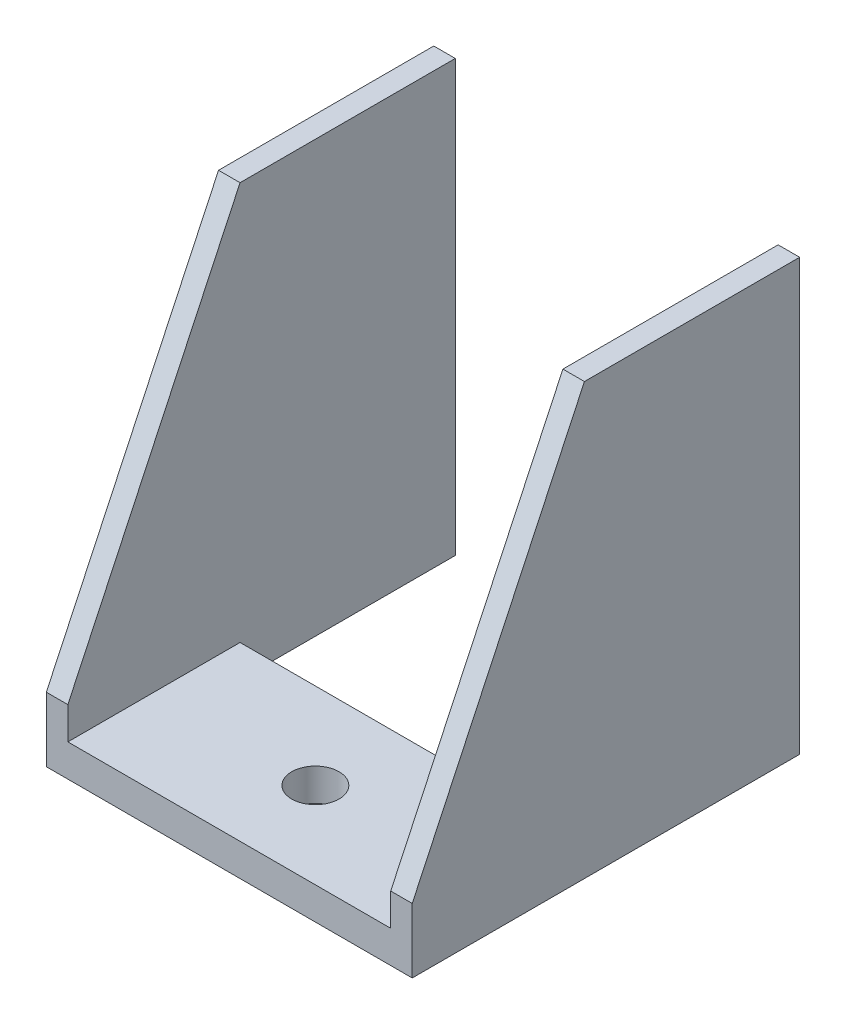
ISO-10303-21;
HEADER;
FILE_DESCRIPTION(('STEP AP214'),'2;1');
FILE_NAME('part.step','',(''),(''),'','','');
FILE_SCHEMA(('AUTOMOTIVE_DESIGN { 1 0 10303 214 1 1 1 1 }'));
ENDSEC;
DATA;
#1=APPLICATION_CONTEXT('core data for automotive mechanical design processes');
#2=APPLICATION_PROTOCOL_DEFINITION('international standard','automotive_design',2000,#1);
#3=PRODUCT_CONTEXT('',#1,'mechanical');
#4=PRODUCT('Part','Part','',(#3));
#5=PRODUCT_RELATED_PRODUCT_CATEGORY('part','',(#4));
#6=PRODUCT_DEFINITION_FORMATION('','',#4);
#7=PRODUCT_DEFINITION_CONTEXT('part definition',#1,'design');
#8=PRODUCT_DEFINITION('design','',#6,#7);
#9=PRODUCT_DEFINITION_SHAPE('','',#8);
#10=(LENGTH_UNIT() NAMED_UNIT(*) SI_UNIT(.MILLI.,.METRE.));
#11=(NAMED_UNIT(*) PLANE_ANGLE_UNIT() SI_UNIT($,.RADIAN.));
#12=(NAMED_UNIT(*) SI_UNIT($,.STERADIAN.) SOLID_ANGLE_UNIT());
#13=UNCERTAINTY_MEASURE_WITH_UNIT(LENGTH_MEASURE(1.E-05),#10,'distance_accuracy_value','');
#14=(GEOMETRIC_REPRESENTATION_CONTEXT(3) GLOBAL_UNCERTAINTY_ASSIGNED_CONTEXT((#13)) GLOBAL_UNIT_ASSIGNED_CONTEXT((#10,
#11,#12)) REPRESENTATION_CONTEXT('',''));
#15=CARTESIAN_POINT('',(0.,0.,0.));
#16=DIRECTION('',(0.,0.,1.));
#17=DIRECTION('',(1.,0.,0.));
#18=AXIS2_PLACEMENT_3D('',#15,#16,#17);
#19=CARTESIAN_POINT('',(0.,15.,0.));
#20=DIRECTION('',(0.,-1.,0.));
#21=DIRECTION('',(0.,0.,-1.));
#22=AXIS2_PLACEMENT_3D('',#19,#20,#21);
#23=PLANE('',#22);
#24=DIRECTION('',(0.,0.,-1.));
#25=VECTOR('',#24,1.);
#26=CARTESIAN_POINT('',(75.,15.,40.));
#27=LINE('',#26,#25);
#28=CARTESIAN_POINT('',(75.,15.,40.));
#29=VERTEX_POINT('',#28);
#30=CARTESIAN_POINT('',(75.,15.,-40.));
#31=VERTEX_POINT('',#30);
#32=EDGE_CURVE('E138',#29,#31,#27,.T.);
#33=ORIENTED_EDGE('',*,*,#32,.T.);
#34=DIRECTION('',(-1.,0.,0.));
#35=VECTOR('',#34,1.);
#36=CARTESIAN_POINT('',(-75.,15.,-40.));
#37=LINE('',#36,#35);
#38=CARTESIAN_POINT('',(-75.,15.,-40.));
#39=VERTEX_POINT('',#38);
#40=EDGE_CURVE('E53',#31,#39,#37,.T.);
#41=ORIENTED_EDGE('',*,*,#40,.T.);
#42=DIRECTION('',(0.,0.,1.));
#43=VECTOR('',#42,1.);
#44=CARTESIAN_POINT('',(-75.,15.,40.));
#45=LINE('',#44,#43);
#46=CARTESIAN_POINT('',(-75.,15.,40.));
#47=VERTEX_POINT('',#46);
#48=EDGE_CURVE('E48',#39,#47,#45,.T.);
#49=ORIENTED_EDGE('',*,*,#48,.T.);
#50=DIRECTION('',(1.,0.,0.));
#51=VECTOR('',#50,1.);
#52=CARTESIAN_POINT('',(-75.,15.,40.));
#53=LINE('',#52,#51);
#54=EDGE_CURVE('E224',#47,#29,#53,.T.);
#55=ORIENTED_EDGE('',*,*,#54,.T.);
#56=EDGE_LOOP('',(#33,#41,#49,#55));
#57=FACE_BOUND('',#56,.T.);
#58=CARTESIAN_POINT('',(0.,15.,0.));
#59=DIRECTION('',(0.,1.,0.));
#60=DIRECTION('',(0.,0.,1.));
#61=AXIS2_PLACEMENT_3D('',#58,#59,#60);
#62=CIRCLE('',#61,11.);
#63=CARTESIAN_POINT('',(0.,15.,11.));
#64=VERTEX_POINT('',#63);
#65=EDGE_CURVE('E216',#64,#64,#62,.T.);
#66=ORIENTED_EDGE('',*,*,#65,.F.);
#67=EDGE_LOOP('',(#66));
#68=FACE_BOUND('',#67,.T.);
#69=ADVANCED_FACE('F33',(#57,#68),#23,.F.);
#70=CARTESIAN_POINT('',(0.,0.,0.));
#71=DIRECTION('',(0.,-1.,0.));
#72=DIRECTION('',(0.,0.,-1.));
#73=AXIS2_PLACEMENT_3D('',#70,#71,#72);
#74=PLANE('',#73);
#75=DIRECTION('',(-1.,0.,0.));
#76=VECTOR('',#75,1.);
#77=CARTESIAN_POINT('',(-75.,0.,-40.));
#78=LINE('',#77,#76);
#79=CARTESIAN_POINT('',(75.,0.,-40.));
#80=VERTEX_POINT('',#79);
#81=CARTESIAN_POINT('',(-75.,0.,-40.));
#82=VERTEX_POINT('',#81);
#83=EDGE_CURVE('E139',#80,#82,#78,.T.);
#84=ORIENTED_EDGE('',*,*,#83,.F.);
#85=DIRECTION('',(0.,0.,-1.));
#86=VECTOR('',#85,1.);
#87=CARTESIAN_POINT('',(75.,0.,40.));
#88=LINE('',#87,#86);
#89=CARTESIAN_POINT('',(75.,0.,-140.));
#90=VERTEX_POINT('',#89);
#91=EDGE_CURVE('E183',#80,#90,#88,.T.);
#92=ORIENTED_EDGE('',*,*,#91,.T.);
#93=DIRECTION('',(-1.,0.,0.));
#94=VECTOR('',#93,1.);
#95=CARTESIAN_POINT('',(85.,0.,-140.));
#96=LINE('',#95,#94);
#97=CARTESIAN_POINT('',(85.,0.,-140.));
#98=VERTEX_POINT('',#97);
#99=EDGE_CURVE('E212',#98,#90,#96,.T.);
#100=ORIENTED_EDGE('',*,*,#99,.F.);
#101=DIRECTION('',(0.,0.,-1.));
#102=VECTOR('',#101,1.);
#103=CARTESIAN_POINT('',(85.,0.,40.));
#104=LINE('',#103,#102);
#105=CARTESIAN_POINT('',(85.,0.,40.));
#106=VERTEX_POINT('',#105);
#107=EDGE_CURVE('E133',#106,#98,#104,.T.);
#108=ORIENTED_EDGE('',*,*,#107,.F.);
#109=DIRECTION('',(1.,0.,0.));
#110=VECTOR('',#109,1.);
#111=CARTESIAN_POINT('',(-75.,0.,40.));
#112=LINE('',#111,#110);
#113=CARTESIAN_POINT('',(-85.,0.,40.));
#114=VERTEX_POINT('',#113);
#115=EDGE_CURVE('E123',#114,#106,#112,.T.);
#116=ORIENTED_EDGE('',*,*,#115,.F.);
#117=DIRECTION('',(0.,0.,-1.));
#118=VECTOR('',#117,1.);
#119=CARTESIAN_POINT('',(-85.,0.,40.));
#120=LINE('',#119,#118);
#121=CARTESIAN_POINT('',(-85.,0.,-140.));
#122=VERTEX_POINT('',#121);
#123=EDGE_CURVE('E129',#114,#122,#120,.T.);
#124=ORIENTED_EDGE('',*,*,#123,.T.);
#125=DIRECTION('',(1.,0.,0.));
#126=VECTOR('',#125,1.);
#127=CARTESIAN_POINT('',(-85.,0.,-140.));
#128=LINE('',#127,#126);
#129=CARTESIAN_POINT('',(-75.,0.,-140.));
#130=VERTEX_POINT('',#129);
#131=EDGE_CURVE('E163',#122,#130,#128,.T.);
#132=ORIENTED_EDGE('',*,*,#131,.T.);
#133=DIRECTION('',(0.,0.,-1.));
#134=VECTOR('',#133,1.);
#135=CARTESIAN_POINT('',(-75.,0.,40.));
#136=LINE('',#135,#134);
#137=EDGE_CURVE('E164',#82,#130,#136,.T.);
#138=ORIENTED_EDGE('',*,*,#137,.F.);
#139=EDGE_LOOP('',(#84,#92,#100,#108,#116,#124,#132,#138));
#140=FACE_BOUND('',#139,.T.);
#141=CARTESIAN_POINT('',(0.,0.,0.));
#142=DIRECTION('',(0.,1.,0.));
#143=DIRECTION('',(0.,0.,1.));
#144=AXIS2_PLACEMENT_3D('',#141,#142,#143);
#145=CIRCLE('',#144,11.);
#146=CARTESIAN_POINT('',(0.,0.,11.));
#147=VERTEX_POINT('',#146);
#148=EDGE_CURVE('E215',#147,#147,#145,.T.);
#149=ORIENTED_EDGE('',*,*,#148,.T.);
#150=EDGE_LOOP('',(#149));
#151=FACE_BOUND('',#150,.T.);
#152=ADVANCED_FACE('F126',(#140,#151),#74,.T.);
#153=CARTESIAN_POINT('',(-75.,15.,-40.));
#154=DIRECTION('',(0.,0.,1.));
#155=DIRECTION('',(1.,0.,0.));
#156=AXIS2_PLACEMENT_3D('',#153,#154,#155);
#157=PLANE('',#156);
#158=ORIENTED_EDGE('',*,*,#83,.T.);
#159=DIRECTION('',(0.,-1.,0.));
#160=VECTOR('',#159,1.);
#161=CARTESIAN_POINT('',(-75.,15.,-40.));
#162=LINE('',#161,#160);
#163=EDGE_CURVE('E41',#39,#82,#162,.T.);
#164=ORIENTED_EDGE('',*,*,#163,.F.);
#165=ORIENTED_EDGE('',*,*,#40,.F.);
#166=DIRECTION('',(0.,-1.,0.));
#167=VECTOR('',#166,1.);
#168=CARTESIAN_POINT('',(75.,15.,-40.));
#169=LINE('',#168,#167);
#170=EDGE_CURVE('E11',#31,#80,#169,.T.);
#171=ORIENTED_EDGE('',*,*,#170,.T.);
#172=EDGE_LOOP('',(#158,#164,#165,#171));
#173=FACE_BOUND('',#172,.T.);
#174=ADVANCED_FACE('F35',(#173),#157,.F.);
#175=CARTESIAN_POINT('',(-75.,15.,40.));
#176=DIRECTION('',(0.,0.,-1.));
#177=DIRECTION('',(-1.,0.,0.));
#178=AXIS2_PLACEMENT_3D('',#175,#176,#177);
#179=PLANE('',#178);
#180=ORIENTED_EDGE('',*,*,#115,.T.);
#181=DIRECTION('',(0.,-1.,0.));
#182=VECTOR('',#181,1.);
#183=CARTESIAN_POINT('',(85.,30.,40.));
#184=LINE('',#183,#182);
#185=CARTESIAN_POINT('',(85.,30.,40.));
#186=VERTEX_POINT('',#185);
#187=EDGE_CURVE('E192',#186,#106,#184,.T.);
#188=ORIENTED_EDGE('',*,*,#187,.F.);
#189=DIRECTION('',(-1.,0.,0.));
#190=VECTOR('',#189,1.);
#191=CARTESIAN_POINT('',(85.,30.,40.));
#192=LINE('',#191,#190);
#193=CARTESIAN_POINT('',(75.,30.,40.));
#194=VERTEX_POINT('',#193);
#195=EDGE_CURVE('E194',#186,#194,#192,.T.);
#196=ORIENTED_EDGE('',*,*,#195,.T.);
#197=DIRECTION('',(0.,-1.,0.));
#198=VECTOR('',#197,1.);
#199=CARTESIAN_POINT('',(75.,30.,40.));
#200=LINE('',#199,#198);
#201=EDGE_CURVE('E186',#194,#29,#200,.T.);
#202=ORIENTED_EDGE('',*,*,#201,.T.);
#203=ORIENTED_EDGE('',*,*,#54,.F.);
#204=DIRECTION('',(0.,-1.,0.));
#205=VECTOR('',#204,1.);
#206=CARTESIAN_POINT('',(-75.,30.,40.));
#207=LINE('',#206,#205);
#208=CARTESIAN_POINT('',(-75.,30.,40.));
#209=VERTEX_POINT('',#208);
#210=EDGE_CURVE('E166',#209,#47,#207,.T.);
#211=ORIENTED_EDGE('',*,*,#210,.F.);
#212=DIRECTION('',(1.,0.,0.));
#213=VECTOR('',#212,1.);
#214=CARTESIAN_POINT('',(-85.,30.,40.));
#215=LINE('',#214,#213);
#216=CARTESIAN_POINT('',(-85.,30.,40.));
#217=VERTEX_POINT('',#216);
#218=EDGE_CURVE('E154',#217,#209,#215,.T.);
#219=ORIENTED_EDGE('',*,*,#218,.F.);
#220=DIRECTION('',(0.,-1.,0.));
#221=VECTOR('',#220,1.);
#222=CARTESIAN_POINT('',(-85.,30.,40.));
#223=LINE('',#222,#221);
#224=EDGE_CURVE('E145',#217,#114,#223,.T.);
#225=ORIENTED_EDGE('',*,*,#224,.T.);
#226=EDGE_LOOP('',(#180,#188,#196,#202,#203,#211,#219,#225));
#227=FACE_BOUND('',#226,.T.);
#228=ADVANCED_FACE('F152',(#227),#179,.F.);
#229=CARTESIAN_POINT('',(0.,15.,0.));
#230=DIRECTION('',(0.,-1.,0.));
#231=DIRECTION('',(0.,0.,-1.));
#232=AXIS2_PLACEMENT_3D('',#229,#230,#231);
#233=CYLINDRICAL_SURFACE('',#232,11.);
#234=ORIENTED_EDGE('',*,*,#65,.T.);
#235=EDGE_LOOP('',(#234));
#236=FACE_BOUND('',#235,.T.);
#237=ORIENTED_EDGE('',*,*,#148,.F.);
#238=EDGE_LOOP('',(#237));
#239=FACE_BOUND('',#238,.T.);
#240=ADVANCED_FACE('F251',(#236,#239),#233,.F.);
#241=CARTESIAN_POINT('',(85.,0.,-140.));
#242=DIRECTION('',(0.,0.,1.));
#243=DIRECTION('',(1.,0.,0.));
#244=AXIS2_PLACEMENT_3D('',#241,#242,#243);
#245=PLANE('',#244);
#246=DIRECTION('',(0.,1.,0.));
#247=VECTOR('',#246,1.);
#248=CARTESIAN_POINT('',(75.,0.,-140.));
#249=LINE('',#248,#247);
#250=CARTESIAN_POINT('',(75.,200.,-140.));
#251=VERTEX_POINT('',#250);
#252=EDGE_CURVE('E196',#90,#251,#249,.T.);
#253=ORIENTED_EDGE('',*,*,#252,.T.);
#254=DIRECTION('',(-1.,0.,0.));
#255=VECTOR('',#254,1.);
#256=CARTESIAN_POINT('',(85.,200.,-140.));
#257=LINE('',#256,#255);
#258=CARTESIAN_POINT('',(85.,200.,-140.));
#259=VERTEX_POINT('',#258);
#260=EDGE_CURVE('E209',#259,#251,#257,.T.);
#261=ORIENTED_EDGE('',*,*,#260,.F.);
#262=DIRECTION('',(0.,1.,0.));
#263=VECTOR('',#262,1.);
#264=CARTESIAN_POINT('',(85.,0.,-140.));
#265=LINE('',#264,#263);
#266=EDGE_CURVE('E185',#98,#259,#265,.T.);
#267=ORIENTED_EDGE('',*,*,#266,.F.);
#268=ORIENTED_EDGE('',*,*,#99,.T.);
#269=EDGE_LOOP('',(#253,#261,#267,#268));
#270=FACE_BOUND('',#269,.T.);
#271=ADVANCED_FACE('F260',(#270),#245,.F.);
#272=CARTESIAN_POINT('',(85.,200.,-140.));
#273=DIRECTION('',(0.,-1.,0.));
#274=DIRECTION('',(0.,0.,-1.));
#275=AXIS2_PLACEMENT_3D('',#272,#273,#274);
#276=PLANE('',#275);
#277=DIRECTION('',(0.,0.,1.));
#278=VECTOR('',#277,1.);
#279=CARTESIAN_POINT('',(75.,200.,-140.));
#280=LINE('',#279,#278);
#281=CARTESIAN_POINT('',(75.,200.,-40.));
#282=VERTEX_POINT('',#281);
#283=EDGE_CURVE('E198',#251,#282,#280,.T.);
#284=ORIENTED_EDGE('',*,*,#283,.T.);
#285=DIRECTION('',(-1.,0.,0.));
#286=VECTOR('',#285,1.);
#287=CARTESIAN_POINT('',(85.,200.,-40.));
#288=LINE('',#287,#286);
#289=CARTESIAN_POINT('',(85.,200.,-40.));
#290=VERTEX_POINT('',#289);
#291=EDGE_CURVE('E206',#290,#282,#288,.T.);
#292=ORIENTED_EDGE('',*,*,#291,.F.);
#293=DIRECTION('',(0.,0.,1.));
#294=VECTOR('',#293,1.);
#295=CARTESIAN_POINT('',(85.,200.,-140.));
#296=LINE('',#295,#294);
#297=EDGE_CURVE('E188',#259,#290,#296,.T.);
#298=ORIENTED_EDGE('',*,*,#297,.F.);
#299=ORIENTED_EDGE('',*,*,#260,.T.);
#300=EDGE_LOOP('',(#284,#292,#298,#299));
#301=FACE_BOUND('',#300,.T.);
#302=ADVANCED_FACE('F264',(#301),#276,.F.);
#303=CARTESIAN_POINT('',(85.,200.,-40.));
#304=DIRECTION('',(0.,-0.42579703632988,-0.904818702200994));
#305=DIRECTION('',(0.,0.904818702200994,-0.42579703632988));
#306=AXIS2_PLACEMENT_3D('',#303,#304,#305);
#307=PLANE('',#306);
#308=DIRECTION('',(0.,-0.904818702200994,0.42579703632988));
#309=VECTOR('',#308,1.);
#310=CARTESIAN_POINT('',(75.,200.,-40.));
#311=LINE('',#310,#309);
#312=EDGE_CURVE('E200',#282,#194,#311,.T.);
#313=ORIENTED_EDGE('',*,*,#312,.T.);
#314=ORIENTED_EDGE('',*,*,#195,.F.);
#315=DIRECTION('',(0.,-0.904818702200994,0.42579703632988));
#316=VECTOR('',#315,1.);
#317=CARTESIAN_POINT('',(85.,200.,-40.));
#318=LINE('',#317,#316);
#319=EDGE_CURVE('E190',#290,#186,#318,.T.);
#320=ORIENTED_EDGE('',*,*,#319,.F.);
#321=ORIENTED_EDGE('',*,*,#291,.T.);
#322=EDGE_LOOP('',(#313,#314,#320,#321));
#323=FACE_BOUND('',#322,.T.);
#324=ADVANCED_FACE('F268',(#323),#307,.F.);
#325=CARTESIAN_POINT('',(85.,0.,0.));
#326=DIRECTION('',(1.,0.,0.));
#327=DIRECTION('',(0.,0.,-1.));
#328=AXIS2_PLACEMENT_3D('',#325,#326,#327);
#329=PLANE('',#328);
#330=ORIENTED_EDGE('',*,*,#107,.T.);
#331=ORIENTED_EDGE('',*,*,#266,.T.);
#332=ORIENTED_EDGE('',*,*,#297,.T.);
#333=ORIENTED_EDGE('',*,*,#319,.T.);
#334=ORIENTED_EDGE('',*,*,#187,.T.);
#335=EDGE_LOOP('',(#330,#331,#332,#333,#334));
#336=FACE_BOUND('',#335,.T.);
#337=ADVANCED_FACE('F272',(#336),#329,.T.);
#338=CARTESIAN_POINT('',(75.,0.,0.));
#339=DIRECTION('',(1.,0.,0.));
#340=DIRECTION('',(0.,0.,-1.));
#341=AXIS2_PLACEMENT_3D('',#338,#339,#340);
#342=PLANE('',#341);
#343=ORIENTED_EDGE('',*,*,#170,.F.);
#344=ORIENTED_EDGE('',*,*,#32,.F.);
#345=ORIENTED_EDGE('',*,*,#201,.F.);
#346=ORIENTED_EDGE('',*,*,#312,.F.);
#347=ORIENTED_EDGE('',*,*,#283,.F.);
#348=ORIENTED_EDGE('',*,*,#252,.F.);
#349=ORIENTED_EDGE('',*,*,#91,.F.);
#350=EDGE_LOOP('',(#343,#344,#345,#346,#347,#348,#349));
#351=FACE_BOUND('',#350,.T.);
#352=ADVANCED_FACE('F243',(#351),#342,.F.);
#353=CARTESIAN_POINT('',(-85.,200.,-40.));
#354=DIRECTION('',(0.,0.42579703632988,0.904818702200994));
#355=DIRECTION('',(0.,-0.904818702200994,0.42579703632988));
#356=AXIS2_PLACEMENT_3D('',#353,#354,#355);
#357=PLANE('',#356);
#358=DIRECTION('',(0.,-0.904818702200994,0.42579703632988));
#359=VECTOR('',#358,1.);
#360=CARTESIAN_POINT('',(-75.,200.,-40.));
#361=LINE('',#360,#359);
#362=CARTESIAN_POINT('',(-75.,200.,-40.));
#363=VERTEX_POINT('',#362);
#364=EDGE_CURVE('E169',#363,#209,#361,.T.);
#365=ORIENTED_EDGE('',*,*,#364,.F.);
#366=DIRECTION('',(1.,0.,0.));
#367=VECTOR('',#366,1.);
#368=CARTESIAN_POINT('',(-85.,200.,-40.));
#369=LINE('',#368,#367);
#370=CARTESIAN_POINT('',(-85.,200.,-40.));
#371=VERTEX_POINT('',#370);
#372=EDGE_CURVE('E180',#371,#363,#369,.T.);
#373=ORIENTED_EDGE('',*,*,#372,.F.);
#374=DIRECTION('',(0.,-0.904818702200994,0.42579703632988));
#375=VECTOR('',#374,1.);
#376=CARTESIAN_POINT('',(-85.,200.,-40.));
#377=LINE('',#376,#375);
#378=EDGE_CURVE('E155',#371,#217,#377,.T.);
#379=ORIENTED_EDGE('',*,*,#378,.T.);
#380=ORIENTED_EDGE('',*,*,#218,.T.);
#381=EDGE_LOOP('',(#365,#373,#379,#380));
#382=FACE_BOUND('',#381,.T.);
#383=ADVANCED_FACE('F239',(#382),#357,.T.);
#384=CARTESIAN_POINT('',(-85.,200.,-140.));
#385=DIRECTION('',(0.,1.,0.));
#386=DIRECTION('',(0.,0.,1.));
#387=AXIS2_PLACEMENT_3D('',#384,#385,#386);
#388=PLANE('',#387);
#389=DIRECTION('',(0.,0.,1.));
#390=VECTOR('',#389,1.);
#391=CARTESIAN_POINT('',(-75.,200.,-140.));
#392=LINE('',#391,#390);
#393=CARTESIAN_POINT('',(-75.,200.,-140.));
#394=VERTEX_POINT('',#393);
#395=EDGE_CURVE('E172',#394,#363,#392,.T.);
#396=ORIENTED_EDGE('',*,*,#395,.F.);
#397=DIRECTION('',(1.,0.,0.));
#398=VECTOR('',#397,1.);
#399=CARTESIAN_POINT('',(-85.,200.,-140.));
#400=LINE('',#399,#398);
#401=CARTESIAN_POINT('',(-85.,200.,-140.));
#402=VERTEX_POINT('',#401);
#403=EDGE_CURVE('E178',#402,#394,#400,.T.);
#404=ORIENTED_EDGE('',*,*,#403,.F.);
#405=DIRECTION('',(0.,0.,1.));
#406=VECTOR('',#405,1.);
#407=CARTESIAN_POINT('',(-85.,200.,-140.));
#408=LINE('',#407,#406);
#409=EDGE_CURVE('E157',#402,#371,#408,.T.);
#410=ORIENTED_EDGE('',*,*,#409,.T.);
#411=ORIENTED_EDGE('',*,*,#372,.T.);
#412=EDGE_LOOP('',(#396,#404,#410,#411));
#413=FACE_BOUND('',#412,.T.);
#414=ADVANCED_FACE('F237',(#413),#388,.T.);
#415=CARTESIAN_POINT('',(-85.,0.,-140.));
#416=DIRECTION('',(0.,0.,-1.));
#417=DIRECTION('',(-1.,0.,0.));
#418=AXIS2_PLACEMENT_3D('',#415,#416,#417);
#419=PLANE('',#418);
#420=DIRECTION('',(0.,1.,0.));
#421=VECTOR('',#420,1.);
#422=CARTESIAN_POINT('',(-75.,0.,-140.));
#423=LINE('',#422,#421);
#424=EDGE_CURVE('E150',#130,#394,#423,.T.);
#425=ORIENTED_EDGE('',*,*,#424,.F.);
#426=ORIENTED_EDGE('',*,*,#131,.F.);
#427=DIRECTION('',(0.,1.,0.));
#428=VECTOR('',#427,1.);
#429=CARTESIAN_POINT('',(-85.,0.,-140.));
#430=LINE('',#429,#428);
#431=EDGE_CURVE('E149',#122,#402,#430,.T.);
#432=ORIENTED_EDGE('',*,*,#431,.T.);
#433=ORIENTED_EDGE('',*,*,#403,.T.);
#434=EDGE_LOOP('',(#425,#426,#432,#433));
#435=FACE_BOUND('',#434,.T.);
#436=ADVANCED_FACE('F233',(#435),#419,.T.);
#437=CARTESIAN_POINT('',(-85.,0.,0.));
#438=DIRECTION('',(-1.,0.,0.));
#439=DIRECTION('',(0.,0.,-1.));
#440=AXIS2_PLACEMENT_3D('',#437,#438,#439);
#441=PLANE('',#440);
#442=ORIENTED_EDGE('',*,*,#123,.F.);
#443=ORIENTED_EDGE('',*,*,#224,.F.);
#444=ORIENTED_EDGE('',*,*,#378,.F.);
#445=ORIENTED_EDGE('',*,*,#409,.F.);
#446=ORIENTED_EDGE('',*,*,#431,.F.);
#447=EDGE_LOOP('',(#442,#443,#444,#445,#446));
#448=FACE_BOUND('',#447,.T.);
#449=ADVANCED_FACE('F143',(#448),#441,.T.);
#450=CARTESIAN_POINT('',(-75.,0.,0.));
#451=DIRECTION('',(-1.,0.,0.));
#452=DIRECTION('',(0.,0.,-1.));
#453=AXIS2_PLACEMENT_3D('',#450,#451,#452);
#454=PLANE('',#453);
#455=ORIENTED_EDGE('',*,*,#48,.F.);
#456=ORIENTED_EDGE('',*,*,#163,.T.);
#457=ORIENTED_EDGE('',*,*,#137,.T.);
#458=ORIENTED_EDGE('',*,*,#424,.T.);
#459=ORIENTED_EDGE('',*,*,#395,.T.);
#460=ORIENTED_EDGE('',*,*,#364,.T.);
#461=ORIENTED_EDGE('',*,*,#210,.T.);
#462=EDGE_LOOP('',(#455,#456,#457,#458,#459,#460,#461));
#463=FACE_BOUND('',#462,.T.);
#464=ADVANCED_FACE('F229',(#463),#454,.F.);
#465=CLOSED_SHELL('',(#69,#152,#174,#228,#240,#271,#302,#324,#337,#352,#383,#414,#436,#449,#464));
#466=MANIFOLD_SOLID_BREP('B2',#465);
#467=ADVANCED_BREP_SHAPE_REPRESENTATION('',(#18,#466),#14);
#468=SHAPE_DEFINITION_REPRESENTATION(#9,#467);
ENDSEC;
END-ISO-10303-21;
